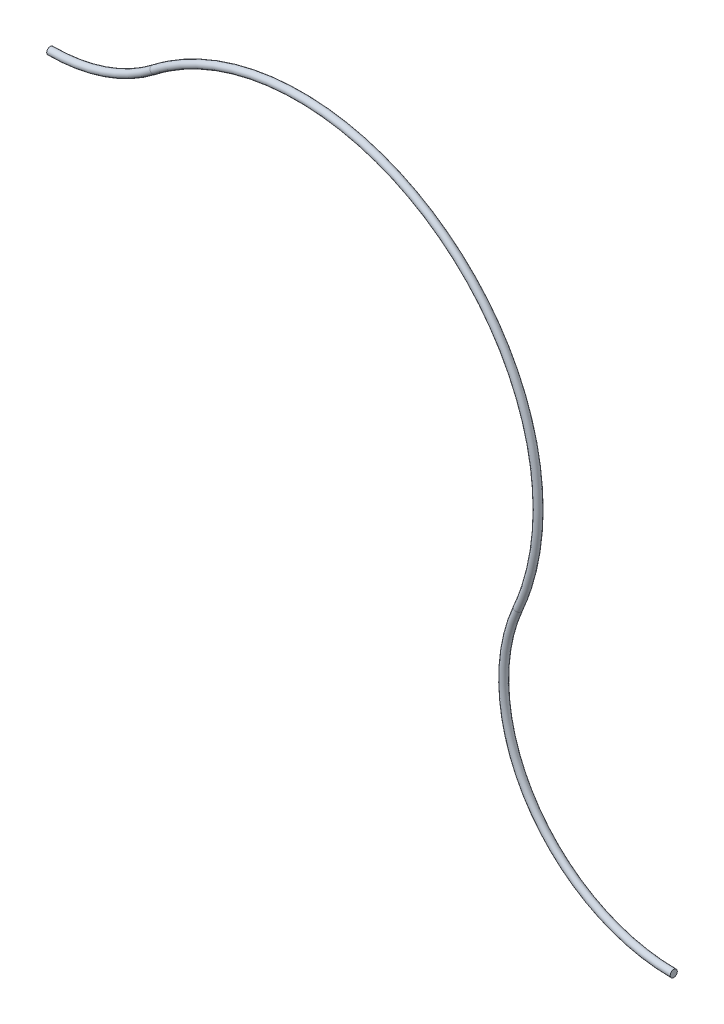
from build123d import *

# Parameters (mm, degrees)
SKETCH2_R = 0.015875


with BuildPart() as part:
    # Sweep1: sweep along a path in Sketch1
    with BuildLine(Plane.XY) as sweep1_path:
        ThreePointArc((0, 0), (0.245834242, 0.04074448), (0.465378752, 0.158620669))
        ThreePointArc((0.465378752, 0.158620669), (1.775803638, 0.154316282), (2.096160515, -1.116354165))
        ThreePointArc((2.096160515, -1.116354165), (2.156092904, -1.839195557), (2.794, -2.1844))
    # Sketch2 → Sweep1 (sweep)
    with BuildSketch(Plane(origin=(0, 0, 0), x_dir=(0, 0, -1), z_dir=(1, 0, 0))):
        Circle(SKETCH2_R)
    sweep(path=sweep1_path.line)


solid = part.part
